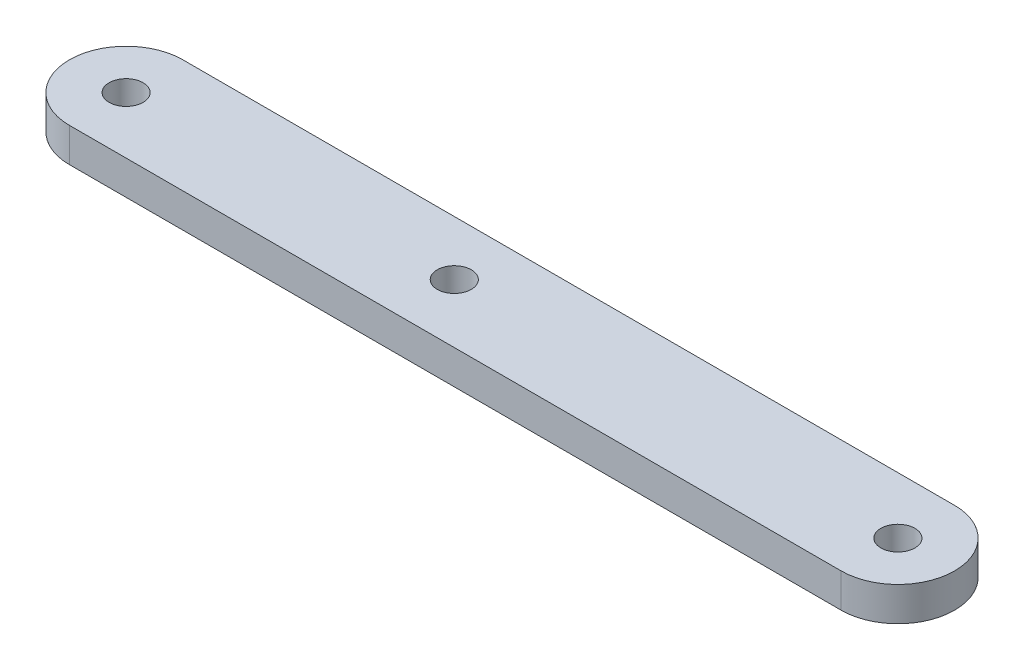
from build123d import *

# Parameters (mm, degrees)
SKETCH1_R           = 1.5
BOSS_EXTRUDE1_DEPTH = 3
SKETCH3_R           = 1.5
CUT_EXTRUDE1_DEPTH  = 3


with BuildPart() as part:
    # Sketch1 → Boss-Extrude1 (new body)
    with BuildSketch(Plane(origin=(0, 0, 0), x_dir=(1, 0, 0), z_dir=(0, 1, 0))):
        with BuildLine():
            Line((-34, 5), (34, 5))
            ThreePointArc((34, 5), (39, 0), (34, -5))
            Line((34, -5), (-34, -5))
            ThreePointArc((-34, -5), (-39, 0), (-34, 5))
        make_face()
        with Locations(Location((-34, 0, 0), (0, 0, 270))):
            Circle(SKETCH1_R, mode=Mode.SUBTRACT)
        with Locations(Location((34, 0, 0), (0, 0, 270))):
            Circle(SKETCH1_R, mode=Mode.SUBTRACT)
    extrude(amount=BOSS_EXTRUDE1_DEPTH)

    # Sketch3 → Cut-Extrude1 (cut)
    with BuildSketch(Plane(origin=(0, 0, 0), x_dir=(-1, 0, 0), z_dir=(0, -1, 0))):
        with Locations(Location((5.271349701, 0.184873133, 0), (0, 0, 90))):
            Circle(SKETCH3_R)
    extrude(amount=-CUT_EXTRUDE1_DEPTH, mode=Mode.SUBTRACT)


solid = part.part
